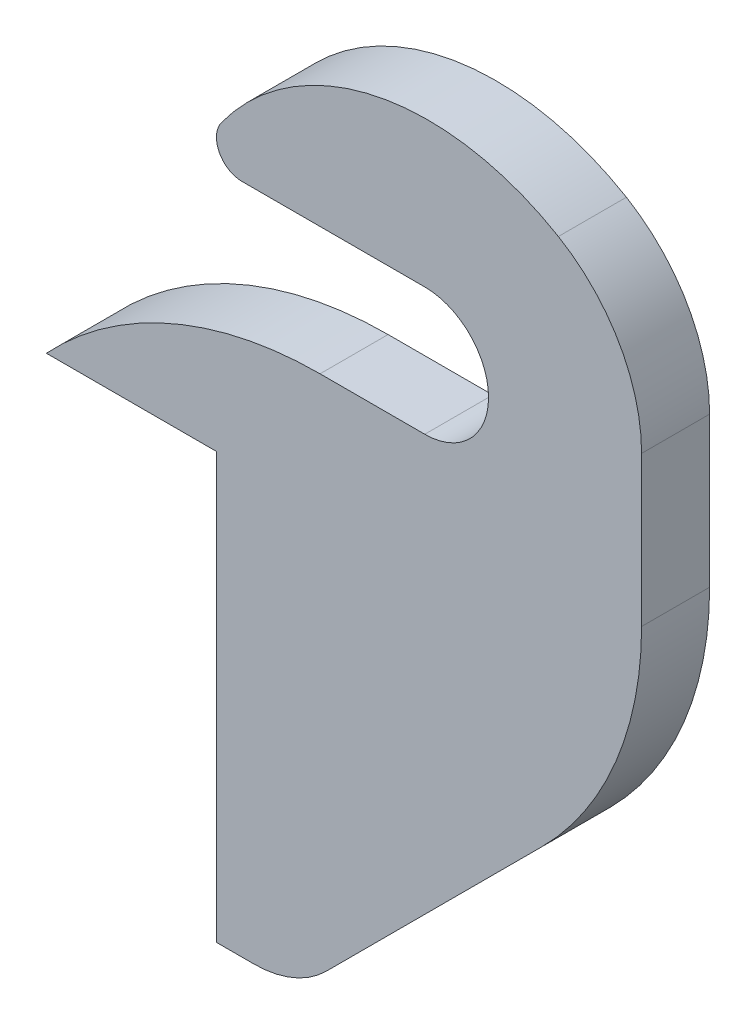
from build123d import *

# Parameters (mm, degrees)
BOSS_EXTRU_1_DEPTH = 4


with BuildPart() as part:
    # Esquisse1 → Boss.-Extru.1 (new body)
    with BuildSketch(Plane.XY):
        with BuildLine():
            Line((0, 0), (-10, 0))
            ThreePointArc((-10, 0), (-2.681487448, 5.174241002), (6.093476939, 7))
            Line((6.093476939, 7), (12.25, 7))
            ThreePointArc((12.25, 7), (16, 10.75), (12.25, 14.5))
            Line((12.25, 14.5), (1.5, 14.5))
            ThreePointArc((1.5, 14.5), (0.164584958, 15.316869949), (0.283650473, 16.877777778))
            ThreePointArc((0.283650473, 16.877777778), (9.394817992, 22.786159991), (20.105708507, 20.997535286))
            ThreePointArc((20.105708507, 20.997535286), (23.690715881, 17.346041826), (25, 12.399178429))
            Line((25, 12.399178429), (25, 3.585786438))
            ThreePointArc((25, 3.585786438), (23.47759065, -4.06788221), (19.142135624, -10.556349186))
            Line((19.142135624, -10.556349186), (6.455844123, -23.242640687))
            ThreePointArc((6.455844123, -23.242640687), (4.50930403, -24.543277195), (2.213203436, -25))
            Line((2.213203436, -25), (0, -25))
            Line((0, -25), (0, 0))
        make_face()
    extrude(amount=BOSS_EXTRU_1_DEPTH)


solid = part.part
